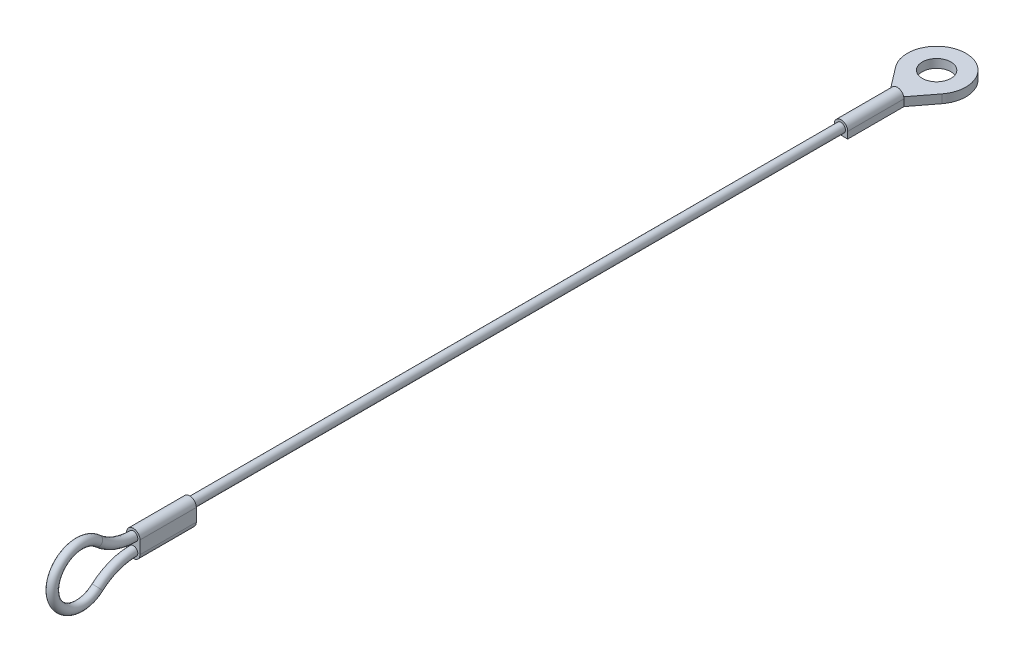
ISO-10303-21;
HEADER;
FILE_DESCRIPTION(('STEP AP214'),'2;1');
FILE_NAME('part.step','',(''),(''),'','','');
FILE_SCHEMA(('AUTOMOTIVE_DESIGN { 1 0 10303 214 1 1 1 1 }'));
ENDSEC;
DATA;
#1=APPLICATION_CONTEXT('core data for automotive mechanical design processes');
#2=APPLICATION_PROTOCOL_DEFINITION('international standard','automotive_design',2000,#1);
#3=PRODUCT_CONTEXT('',#1,'mechanical');
#4=PRODUCT('Part','Part','',(#3));
#5=PRODUCT_RELATED_PRODUCT_CATEGORY('part','',(#4));
#6=PRODUCT_DEFINITION_FORMATION('','',#4);
#7=PRODUCT_DEFINITION_CONTEXT('part definition',#1,'design');
#8=PRODUCT_DEFINITION('design','',#6,#7);
#9=PRODUCT_DEFINITION_SHAPE('','',#8);
#10=(LENGTH_UNIT() NAMED_UNIT(*) SI_UNIT(.MILLI.,.METRE.));
#11=(NAMED_UNIT(*) PLANE_ANGLE_UNIT() SI_UNIT($,.RADIAN.));
#12=(NAMED_UNIT(*) SI_UNIT($,.STERADIAN.) SOLID_ANGLE_UNIT());
#13=UNCERTAINTY_MEASURE_WITH_UNIT(LENGTH_MEASURE(1.E-05),#10,'distance_accuracy_value','');
#14=(GEOMETRIC_REPRESENTATION_CONTEXT(3) GLOBAL_UNCERTAINTY_ASSIGNED_CONTEXT((#13)) GLOBAL_UNIT_ASSIGNED_CONTEXT((#10,
#11,#12)) REPRESENTATION_CONTEXT('',''));
#15=CARTESIAN_POINT('',(0.,0.,0.));
#16=DIRECTION('',(0.,0.,1.));
#17=DIRECTION('',(1.,0.,0.));
#18=AXIS2_PLACEMENT_3D('',#15,#16,#17);
#19=CARTESIAN_POINT('',(0.,0.,-10.));
#20=DIRECTION('',(0.,0.,-1.));
#21=DIRECTION('',(-1.,0.,0.));
#22=AXIS2_PLACEMENT_3D('',#19,#20,#21);
#23=PLANE('',#22);
#24=CARTESIAN_POINT('',(0.,0.,-10.));
#25=DIRECTION('',(0.,0.,-1.));
#26=DIRECTION('',(-1.,0.,0.));
#27=AXIS2_PLACEMENT_3D('',#24,#25,#26);
#28=CIRCLE('',#27,1.195);
#29=CARTESIAN_POINT('',(-1.1499565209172,0.325,-10.));
#30=VERTEX_POINT('',#29);
#31=CARTESIAN_POINT('',(1.1499565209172,0.325,-10.));
#32=VERTEX_POINT('',#31);
#33=EDGE_CURVE('E200',#30,#32,#28,.T.);
#34=ORIENTED_EDGE('',*,*,#33,.T.);
#35=DIRECTION('',(-1.,0.,0.));
#36=VECTOR('',#35,1.);
#37=CARTESIAN_POINT('',(-1.195,0.325,-10.));
#38=LINE('',#37,#36);
#39=EDGE_CURVE('E11',#32,#30,#38,.T.);
#40=ORIENTED_EDGE('',*,*,#39,.T.);
#41=EDGE_LOOP('',(#34,#40));
#42=FACE_BOUND('',#41,.T.);
#43=ADVANCED_FACE('F39',(#42),#23,.T.);
#44=CARTESIAN_POINT('',(0.,0.,125.8));
#45=DIRECTION('',(0.,0.,-1.));
#46=DIRECTION('',(-1.,0.,0.));
#47=AXIS2_PLACEMENT_3D('',#44,#45,#46);
#48=CYLINDRICAL_SURFACE('',#47,0.795);
#49=CARTESIAN_POINT('',(0.,0.,115.8));
#50=DIRECTION('',(0.,0.,-1.));
#51=DIRECTION('',(0.,1.,0.));
#52=AXIS2_PLACEMENT_3D('',#49,#50,#51);
#53=CIRCLE('',#52,0.795);
#54=CARTESIAN_POINT('',(0.,0.795,115.8));
#55=VERTEX_POINT('',#54);
#56=EDGE_CURVE('E43',#55,#55,#53,.T.);
#57=ORIENTED_EDGE('',*,*,#56,.T.);
#58=EDGE_LOOP('',(#57));
#59=FACE_BOUND('',#58,.T.);
#60=CARTESIAN_POINT('',(0.,0.,0.));
#61=DIRECTION('',(0.,0.,1.));
#62=DIRECTION('',(1.,0.,0.));
#63=AXIS2_PLACEMENT_3D('',#60,#61,#62);
#64=CIRCLE('',#63,0.795);
#65=CARTESIAN_POINT('',(0.795,0.,0.));
#66=VERTEX_POINT('',#65);
#67=EDGE_CURVE('E236',#66,#66,#64,.T.);
#68=ORIENTED_EDGE('',*,*,#67,.T.);
#69=EDGE_LOOP('',(#68));
#70=FACE_BOUND('',#69,.T.);
#71=ADVANCED_FACE('F41',(#59,#70),#48,.T.);
#72=CARTESIAN_POINT('',(0.,1.99637760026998E-12,115.8));
#73=DIRECTION('',(0.,0.,1.));
#74=DIRECTION('',(0.,-1.,0.));
#75=AXIS2_PLACEMENT_3D('',#72,#73,#74);
#76=CYLINDRICAL_SURFACE('',#75,1.195);
#77=CARTESIAN_POINT('',(0.,2.01083362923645E-12,125.8));
#78=DIRECTION('',(0.,0.,-1.));
#79=DIRECTION('',(0.,1.,0.));
#80=AXIS2_PLACEMENT_3D('',#77,#78,#79);
#81=CIRCLE('',#80,1.195);
#82=CARTESIAN_POINT('',(-1.195,2.01097997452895E-12,125.8));
#83=VERTEX_POINT('',#82);
#84=CARTESIAN_POINT('',(1.195,2.01068728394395E-12,125.8));
#85=VERTEX_POINT('',#84);
#86=EDGE_CURVE('E248',#83,#85,#81,.T.);
#87=ORIENTED_EDGE('',*,*,#86,.T.);
#88=DIRECTION('',(0.,0.,1.));
#89=VECTOR('',#88,1.);
#90=CARTESIAN_POINT('',(1.195,1.99623125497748E-12,115.8));
#91=LINE('',#90,#89);
#92=CARTESIAN_POINT('',(1.195,1.99623125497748E-12,115.8));
#93=VERTEX_POINT('',#92);
#94=EDGE_CURVE('E269',#93,#85,#91,.T.);
#95=ORIENTED_EDGE('',*,*,#94,.F.);
#96=CARTESIAN_POINT('',(0.,1.99637760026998E-12,115.8));
#97=DIRECTION('',(0.,0.,-1.));
#98=DIRECTION('',(0.,1.,0.));
#99=AXIS2_PLACEMENT_3D('',#96,#97,#98);
#100=CIRCLE('',#99,1.195);
#101=CARTESIAN_POINT('',(-1.195,1.99652394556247E-12,115.8));
#102=VERTEX_POINT('',#101);
#103=EDGE_CURVE('E237',#102,#93,#100,.T.);
#104=ORIENTED_EDGE('',*,*,#103,.F.);
#105=DIRECTION('',(0.,0.,1.));
#106=VECTOR('',#105,1.);
#107=CARTESIAN_POINT('',(-1.195,1.99652394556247E-12,115.8));
#108=LINE('',#107,#106);
#109=EDGE_CURVE('E247',#102,#83,#108,.T.);
#110=ORIENTED_EDGE('',*,*,#109,.T.);
#111=EDGE_LOOP('',(#87,#95,#104,#110));
#112=FACE_BOUND('',#111,.T.);
#113=ADVANCED_FACE('F329',(#112),#76,.T.);
#114=CARTESIAN_POINT('',(1.195,1.99623125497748E-12,115.8));
#115=DIRECTION('',(-1.,0.,0.));
#116=DIRECTION('',(0.,-1.,0.));
#117=AXIS2_PLACEMENT_3D('',#114,#115,#116);
#118=PLANE('',#117);
#119=DIRECTION('',(0.,-1.,0.));
#120=VECTOR('',#119,1.);
#121=CARTESIAN_POINT('',(1.195,2.01068728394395E-12,125.8));
#122=LINE('',#121,#120);
#123=CARTESIAN_POINT('',(1.195,-2.26625258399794,125.8));
#124=VERTEX_POINT('',#123);
#125=EDGE_CURVE('E252',#85,#124,#122,.T.);
#126=ORIENTED_EDGE('',*,*,#125,.T.);
#127=DIRECTION('',(0.,0.,1.));
#128=VECTOR('',#127,1.);
#129=CARTESIAN_POINT('',(1.195,-2.26625258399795,115.8));
#130=LINE('',#129,#128);
#131=CARTESIAN_POINT('',(1.195,-2.26625258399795,115.8));
#132=VERTEX_POINT('',#131);
#133=EDGE_CURVE('E265',#132,#124,#130,.T.);
#134=ORIENTED_EDGE('',*,*,#133,.F.);
#135=DIRECTION('',(0.,-1.,0.));
#136=VECTOR('',#135,1.);
#137=CARTESIAN_POINT('',(1.195,1.99623125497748E-12,115.8));
#138=LINE('',#137,#136);
#139=EDGE_CURVE('E96',#93,#132,#138,.T.);
#140=ORIENTED_EDGE('',*,*,#139,.F.);
#141=ORIENTED_EDGE('',*,*,#94,.T.);
#142=EDGE_LOOP('',(#126,#134,#140,#141));
#143=FACE_BOUND('',#142,.T.);
#144=ADVANCED_FACE('F358',(#143),#118,.F.);
#145=CARTESIAN_POINT('',(0.,-2.26625258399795,115.8));
#146=DIRECTION('',(0.,0.,1.));
#147=DIRECTION('',(0.,-1.,0.));
#148=AXIS2_PLACEMENT_3D('',#145,#146,#147);
#149=CYLINDRICAL_SURFACE('',#148,1.195);
#150=CARTESIAN_POINT('',(0.,-2.26625258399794,125.8));
#151=DIRECTION('',(0.,0.,-1.));
#152=DIRECTION('',(0.,1.,0.));
#153=AXIS2_PLACEMENT_3D('',#150,#151,#152);
#154=CIRCLE('',#153,1.195);
#155=CARTESIAN_POINT('',(-1.195,-2.26625258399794,125.8));
#156=VERTEX_POINT('',#155);
#157=EDGE_CURVE('E255',#124,#156,#154,.T.);
#158=ORIENTED_EDGE('',*,*,#157,.T.);
#159=DIRECTION('',(0.,0.,1.));
#160=VECTOR('',#159,1.);
#161=CARTESIAN_POINT('',(-1.195,-2.26625258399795,115.8));
#162=LINE('',#161,#160);
#163=CARTESIAN_POINT('',(-1.195,-2.26625258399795,115.8));
#164=VERTEX_POINT('',#163);
#165=EDGE_CURVE('E262',#164,#156,#162,.T.);
#166=ORIENTED_EDGE('',*,*,#165,.F.);
#167=CARTESIAN_POINT('',(0.,-2.26625258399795,115.8));
#168=DIRECTION('',(0.,0.,-1.));
#169=DIRECTION('',(0.,1.,0.));
#170=AXIS2_PLACEMENT_3D('',#167,#168,#169);
#171=CIRCLE('',#170,1.195);
#172=EDGE_CURVE('E242',#132,#164,#171,.T.);
#173=ORIENTED_EDGE('',*,*,#172,.F.);
#174=ORIENTED_EDGE('',*,*,#133,.T.);
#175=EDGE_LOOP('',(#158,#166,#173,#174));
#176=FACE_BOUND('',#175,.T.);
#177=ADVANCED_FACE('F355',(#176),#149,.T.);
#178=CARTESIAN_POINT('',(-1.195,1.99652394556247E-12,115.8));
#179=DIRECTION('',(1.,0.,0.));
#180=DIRECTION('',(0.,0.,-1.));
#181=AXIS2_PLACEMENT_3D('',#178,#179,#180);
#182=PLANE('',#181);
#183=DIRECTION('',(0.,1.,0.));
#184=VECTOR('',#183,1.);
#185=CARTESIAN_POINT('',(-1.195,2.01097997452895E-12,125.8));
#186=LINE('',#185,#184);
#187=EDGE_CURVE('E88',#156,#83,#186,.T.);
#188=ORIENTED_EDGE('',*,*,#187,.T.);
#189=ORIENTED_EDGE('',*,*,#109,.F.);
#190=DIRECTION('',(0.,1.,0.));
#191=VECTOR('',#190,1.);
#192=CARTESIAN_POINT('',(-1.195,1.99652394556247E-12,115.8));
#193=LINE('',#192,#191);
#194=EDGE_CURVE('E67',#164,#102,#193,.T.);
#195=ORIENTED_EDGE('',*,*,#194,.F.);
#196=ORIENTED_EDGE('',*,*,#165,.T.);
#197=EDGE_LOOP('',(#188,#189,#195,#196));
#198=FACE_BOUND('',#197,.T.);
#199=ADVANCED_FACE('F347',(#198),#182,.F.);
#200=CARTESIAN_POINT('',(0.,1.99637760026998E-12,115.8));
#201=DIRECTION('',(0.,0.,-1.));
#202=DIRECTION('',(0.,1.,0.));
#203=AXIS2_PLACEMENT_3D('',#200,#201,#202);
#204=PLANE('',#203);
#205=ORIENTED_EDGE('',*,*,#56,.F.);
#206=EDGE_LOOP('',(#205));
#207=FACE_BOUND('',#206,.T.);
#208=ORIENTED_EDGE('',*,*,#103,.T.);
#209=ORIENTED_EDGE('',*,*,#139,.T.);
#210=ORIENTED_EDGE('',*,*,#172,.T.);
#211=ORIENTED_EDGE('',*,*,#194,.T.);
#212=EDGE_LOOP('',(#208,#209,#210,#211));
#213=FACE_BOUND('',#212,.T.);
#214=ADVANCED_FACE('F343',(#207,#213),#204,.T.);
#215=CARTESIAN_POINT('',(0.,2.01083362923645E-12,125.8));
#216=DIRECTION('',(0.,0.,-1.));
#217=DIRECTION('',(0.,1.,0.));
#218=AXIS2_PLACEMENT_3D('',#215,#216,#217);
#219=PLANE('',#218);
#220=CARTESIAN_POINT('',(0.,-2.26625258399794,125.8));
#221=DIRECTION('',(0.,0.,-1.));
#222=DIRECTION('',(1.,0.,0.));
#223=AXIS2_PLACEMENT_3D('',#220,#221,#222);
#224=CIRCLE('',#223,0.795);
#225=CARTESIAN_POINT('',(0.,-1.47125258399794,125.8));
#226=VERTEX_POINT('',#225);
#227=EDGE_CURVE('E276',#226,#226,#224,.T.);
#228=ORIENTED_EDGE('',*,*,#227,.T.);
#229=EDGE_LOOP('',(#228));
#230=FACE_BOUND('',#229,.T.);
#231=CARTESIAN_POINT('',(0.,0.,125.8));
#232=DIRECTION('',(0.,0.,-1.));
#233=DIRECTION('',(0.,1.,0.));
#234=AXIS2_PLACEMENT_3D('',#231,#232,#233);
#235=CIRCLE('',#234,0.795);
#236=CARTESIAN_POINT('',(0.,-0.794999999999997,125.8));
#237=VERTEX_POINT('',#236);
#238=EDGE_CURVE('E272',#237,#237,#235,.T.);
#239=ORIENTED_EDGE('',*,*,#238,.T.);
#240=EDGE_LOOP('',(#239));
#241=FACE_BOUND('',#240,.T.);
#242=ORIENTED_EDGE('',*,*,#86,.F.);
#243=ORIENTED_EDGE('',*,*,#187,.F.);
#244=ORIENTED_EDGE('',*,*,#157,.F.);
#245=ORIENTED_EDGE('',*,*,#125,.F.);
#246=EDGE_LOOP('',(#242,#243,#244,#245));
#247=FACE_BOUND('',#246,.T.);
#248=ADVANCED_FACE('F346',(#230,#241,#247),#219,.F.);
#249=CARTESIAN_POINT('',(0.,-11.8662525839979,125.8));
#250=DIRECTION('',(1.,0.,0.));
#251=DIRECTION('',(0.,0.,-1.));
#252=AXIS2_PLACEMENT_3D('',#249,#250,#251);
#253=TOROIDAL_SURFACE('',#252,9.6,0.795);
#254=CARTESIAN_POINT('',(0.,-4.71083505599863,132.2));
#255=DIRECTION('',(0.,0.666666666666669,-0.745355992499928));
#256=DIRECTION('',(1.,0.,0.));
#257=AXIS2_PLACEMENT_3D('',#254,#255,#256);
#258=CIRCLE('',#257,0.795);
#259=CARTESIAN_POINT('',(0.,-4.11827704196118,132.73));
#260=VERTEX_POINT('',#259);
#261=EDGE_CURVE('E279',#260,#260,#258,.T.);
#262=CARTESIAN_POINT('',(0.,-11.8662525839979,125.8));
#263=DIRECTION('',(1.,0.,0.));
#264=DIRECTION('',(0.,0.,-1.));
#265=AXIS2_PLACEMENT_3D('',#262,#263,#264);
#266=CIRCLE('',#265,10.395);
#267=EDGE_CURVE('',#226,#260,#266,.T.);
#268=ORIENTED_EDGE('',*,*,#227,.F.);
#269=ORIENTED_EDGE('',*,*,#261,.T.);
#270=ORIENTED_EDGE('',*,*,#267,.T.);
#271=ORIENTED_EDGE('',*,*,#267,.F.);
#272=EDGE_LOOP('',(#268,#270,#269,#271));
#273=FACE_BOUND('',#272,.T.);
#274=ADVANCED_FACE('F351',(#273),#253,.T.);
#275=CARTESIAN_POINT('',(0.,-1.13312629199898,135.4));
#276=DIRECTION('',(-1.,0.,0.));
#277=DIRECTION('',(0.,0.,1.));
#278=AXIS2_PLACEMENT_3D('',#275,#276,#277);
#279=TOROIDAL_SURFACE('',#278,4.8,0.795);
#280=CARTESIAN_POINT('',(0.,2.44458247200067,132.2));
#281=DIRECTION('',(0.,0.666666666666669,0.745355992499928));
#282=DIRECTION('',(1.,0.,0.));
#283=AXIS2_PLACEMENT_3D('',#280,#281,#282);
#284=CIRCLE('',#283,0.795);
#285=CARTESIAN_POINT('',(0.,1.85202445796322,132.73));
#286=VERTEX_POINT('',#285);
#287=EDGE_CURVE('E49',#286,#286,#284,.T.);
#288=ORIENTED_EDGE('',*,*,#287,.T.);
#289=EDGE_LOOP('',(#288));
#290=FACE_BOUND('',#289,.T.);
#291=ORIENTED_EDGE('',*,*,#261,.F.);
#292=EDGE_LOOP('',(#291));
#293=FACE_BOUND('',#292,.T.);
#294=ADVANCED_FACE('F367',(#290,#293),#279,.T.);
#295=CARTESIAN_POINT('',(0.,9.6,125.8));
#296=DIRECTION('',(1.,0.,0.));
#297=DIRECTION('',(0.,0.,-1.));
#298=AXIS2_PLACEMENT_3D('',#295,#296,#297);
#299=TOROIDAL_SURFACE('',#298,9.6,0.795);
#300=CARTESIAN_POINT('',(0.,9.6,125.8));
#301=DIRECTION('',(1.,0.,0.));
#302=DIRECTION('',(0.,0.,-1.));
#303=AXIS2_PLACEMENT_3D('',#300,#301,#302);
#304=CIRCLE('',#303,10.395);
#305=EDGE_CURVE('',#286,#237,#304,.T.);
#306=ORIENTED_EDGE('',*,*,#287,.F.);
#307=ORIENTED_EDGE('',*,*,#238,.F.);
#308=ORIENTED_EDGE('',*,*,#305,.T.);
#309=ORIENTED_EDGE('',*,*,#305,.F.);
#310=EDGE_LOOP('',(#306,#308,#307,#309));
#311=FACE_BOUND('',#310,.T.);
#312=ADVANCED_FACE('F342',(#311),#299,.T.);
#313=CARTESIAN_POINT('',(0.,0.,-10.));
#314=DIRECTION('',(0.,0.,1.));
#315=DIRECTION('',(1.,0.,0.));
#316=AXIS2_PLACEMENT_3D('',#313,#314,#315);
#317=CYLINDRICAL_SURFACE('',#316,1.195);
#318=CARTESIAN_POINT('',(0.,0.,0.));
#319=DIRECTION('',(0.,0.,-1.));
#320=DIRECTION('',(-1.,0.,0.));
#321=AXIS2_PLACEMENT_3D('',#318,#319,#320);
#322=CIRCLE('',#321,1.195);
#323=CARTESIAN_POINT('',(-1.195,0.,0.));
#324=VERTEX_POINT('',#323);
#325=CARTESIAN_POINT('',(1.195,0.,0.));
#326=VERTEX_POINT('',#325);
#327=EDGE_CURVE('E189',#324,#326,#322,.T.);
#328=ORIENTED_EDGE('',*,*,#327,.T.);
#329=DIRECTION('',(0.,0.,1.));
#330=VECTOR('',#329,1.);
#331=CARTESIAN_POINT('',(1.195,0.,-10.));
#332=LINE('',#331,#330);
#333=CARTESIAN_POINT('',(1.195,0.,-10.));
#334=VERTEX_POINT('',#333);
#335=EDGE_CURVE('E232',#334,#326,#332,.T.);
#336=ORIENTED_EDGE('',*,*,#335,.F.);
#337=EDGE_CURVE('E201',#32,#334,#28,.T.);
#338=ORIENTED_EDGE('',*,*,#337,.F.);
#339=ORIENTED_EDGE('',*,*,#33,.F.);
#340=CARTESIAN_POINT('',(-1.195,0.,-10.));
#341=VERTEX_POINT('',#340);
#342=EDGE_CURVE('E196',#341,#30,#28,.T.);
#343=ORIENTED_EDGE('',*,*,#342,.F.);
#344=DIRECTION('',(0.,0.,1.));
#345=VECTOR('',#344,1.);
#346=CARTESIAN_POINT('',(-1.195,0.,-10.));
#347=LINE('',#346,#345);
#348=EDGE_CURVE('E207',#341,#324,#347,.T.);
#349=ORIENTED_EDGE('',*,*,#348,.T.);
#350=EDGE_LOOP('',(#328,#336,#338,#339,#343,#349));
#351=FACE_BOUND('',#350,.T.);
#352=ADVANCED_FACE('F300',(#351),#317,.T.);
#353=CARTESIAN_POINT('',(1.195,0.,-10.));
#354=DIRECTION('',(-1.,0.,0.));
#355=DIRECTION('',(0.,-1.,0.));
#356=AXIS2_PLACEMENT_3D('',#353,#354,#355);
#357=PLANE('',#356);
#358=DIRECTION('',(0.,-1.,0.));
#359=VECTOR('',#358,1.);
#360=CARTESIAN_POINT('',(1.195,0.,0.));
#361=LINE('',#360,#359);
#362=CARTESIAN_POINT('',(1.195,-1.195,0.));
#363=VERTEX_POINT('',#362);
#364=EDGE_CURVE('E211',#326,#363,#361,.T.);
#365=ORIENTED_EDGE('',*,*,#364,.T.);
#366=DIRECTION('',(0.,0.,1.));
#367=VECTOR('',#366,1.);
#368=CARTESIAN_POINT('',(1.195,-1.195,-10.));
#369=LINE('',#368,#367);
#370=CARTESIAN_POINT('',(1.195,-1.195,-10.));
#371=VERTEX_POINT('',#370);
#372=EDGE_CURVE('E228',#371,#363,#369,.T.);
#373=ORIENTED_EDGE('',*,*,#372,.F.);
#374=DIRECTION('',(0.,-1.,0.));
#375=VECTOR('',#374,1.);
#376=CARTESIAN_POINT('',(1.195,0.,-10.));
#377=LINE('',#376,#375);
#378=EDGE_CURVE('E199',#334,#371,#377,.T.);
#379=ORIENTED_EDGE('',*,*,#378,.F.);
#380=ORIENTED_EDGE('',*,*,#335,.T.);
#381=EDGE_LOOP('',(#365,#373,#379,#380));
#382=FACE_BOUND('',#381,.T.);
#383=ADVANCED_FACE('F313',(#382),#357,.F.);
#384=CARTESIAN_POINT('',(0.,-1.195,-10.));
#385=DIRECTION('',(0.,1.,0.));
#386=DIRECTION('',(0.,0.,1.));
#387=AXIS2_PLACEMENT_3D('',#384,#385,#386);
#388=PLANE('',#387);
#389=DIRECTION('',(-1.,0.,0.));
#390=VECTOR('',#389,1.);
#391=CARTESIAN_POINT('',(0.,-1.195,0.));
#392=LINE('',#391,#390);
#393=CARTESIAN_POINT('',(-1.195,-1.195,0.));
#394=VERTEX_POINT('',#393);
#395=EDGE_CURVE('E215',#363,#394,#392,.T.);
#396=ORIENTED_EDGE('',*,*,#395,.T.);
#397=DIRECTION('',(0.,0.,1.));
#398=VECTOR('',#397,1.);
#399=CARTESIAN_POINT('',(-1.195,-1.195,-10.));
#400=LINE('',#399,#398);
#401=CARTESIAN_POINT('',(-1.195,-1.195,-10.));
#402=VERTEX_POINT('',#401);
#403=EDGE_CURVE('E224',#402,#394,#400,.T.);
#404=ORIENTED_EDGE('',*,*,#403,.F.);
#405=DIRECTION('',(-0.608040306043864,0.,-0.793906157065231));
#406=VECTOR('',#405,1.);
#407=CARTESIAN_POINT('',(-4.13228154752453,-1.195,-13.8351502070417));
#408=LINE('',#407,#406);
#409=CARTESIAN_POINT('',(-4.13228154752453,-1.195,-13.8351502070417));
#410=VERTEX_POINT('',#409);
#411=EDGE_CURVE('E181',#402,#410,#408,.T.);
#412=ORIENTED_EDGE('',*,*,#411,.T.);
#413=CARTESIAN_POINT('',(0.,-1.195,-17.));
#414=DIRECTION('',(0.,-1.,0.));
#415=DIRECTION('',(0.,0.,1.));
#416=AXIS2_PLACEMENT_3D('',#413,#414,#415);
#417=CIRCLE('',#416,5.205);
#418=CARTESIAN_POINT('',(4.13228154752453,-1.195,-13.8351502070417));
#419=VERTEX_POINT('',#418);
#420=EDGE_CURVE('E147',#410,#419,#417,.T.);
#421=ORIENTED_EDGE('',*,*,#420,.T.);
#422=DIRECTION('',(-0.608040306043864,0.,0.793906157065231));
#423=VECTOR('',#422,1.);
#424=CARTESIAN_POINT('',(1.195,-1.195,-10.));
#425=LINE('',#424,#423);
#426=EDGE_CURVE('E167',#419,#371,#425,.T.);
#427=ORIENTED_EDGE('',*,*,#426,.T.);
#428=ORIENTED_EDGE('',*,*,#372,.T.);
#429=EDGE_LOOP('',(#396,#404,#412,#421,#427,#428));
#430=FACE_BOUND('',#429,.T.);
#431=CARTESIAN_POINT('',(0.,-1.195,-17.));
#432=DIRECTION('',(0.,-1.,0.));
#433=DIRECTION('',(0.,0.,-1.));
#434=AXIS2_PLACEMENT_3D('',#431,#432,#433);
#435=CIRCLE('',#434,2.54);
#436=CARTESIAN_POINT('',(0.,-1.195,-19.54));
#437=VERTEX_POINT('',#436);
#438=EDGE_CURVE('E174',#437,#437,#435,.T.);
#439=ORIENTED_EDGE('',*,*,#438,.F.);
#440=EDGE_LOOP('',(#439));
#441=FACE_BOUND('',#440,.T.);
#442=ADVANCED_FACE('F309',(#430,#441),#388,.F.);
#443=CARTESIAN_POINT('',(-1.195,-1.195,-10.));
#444=DIRECTION('',(1.,0.,0.));
#445=DIRECTION('',(0.,1.,0.));
#446=AXIS2_PLACEMENT_3D('',#443,#444,#445);
#447=PLANE('',#446);
#448=DIRECTION('',(0.,1.,0.));
#449=VECTOR('',#448,1.);
#450=CARTESIAN_POINT('',(-1.195,-1.195,0.));
#451=LINE('',#450,#449);
#452=EDGE_CURVE('E218',#394,#324,#451,.T.);
#453=ORIENTED_EDGE('',*,*,#452,.T.);
#454=ORIENTED_EDGE('',*,*,#348,.F.);
#455=DIRECTION('',(0.,1.,0.));
#456=VECTOR('',#455,1.);
#457=CARTESIAN_POINT('',(-1.195,-1.195,-10.));
#458=LINE('',#457,#456);
#459=EDGE_CURVE('E204',#402,#341,#458,.T.);
#460=ORIENTED_EDGE('',*,*,#459,.F.);
#461=ORIENTED_EDGE('',*,*,#403,.T.);
#462=EDGE_LOOP('',(#453,#454,#460,#461));
#463=FACE_BOUND('',#462,.T.);
#464=ADVANCED_FACE('F294',(#463),#447,.F.);
#465=CARTESIAN_POINT('',(0.,0.,0.));
#466=DIRECTION('',(0.,0.,-1.));
#467=DIRECTION('',(-1.,0.,0.));
#468=AXIS2_PLACEMENT_3D('',#465,#466,#467);
#469=PLANE('',#468);
#470=ORIENTED_EDGE('',*,*,#67,.F.);
#471=EDGE_LOOP('',(#470));
#472=FACE_BOUND('',#471,.T.);
#473=ORIENTED_EDGE('',*,*,#327,.F.);
#474=ORIENTED_EDGE('',*,*,#452,.F.);
#475=ORIENTED_EDGE('',*,*,#395,.F.);
#476=ORIENTED_EDGE('',*,*,#364,.F.);
#477=EDGE_LOOP('',(#473,#474,#475,#476));
#478=FACE_BOUND('',#477,.T.);
#479=ADVANCED_FACE('F290',(#472,#478),#469,.F.);
#480=CARTESIAN_POINT('',(-1.195,0.325,-10.));
#481=DIRECTION('',(0.,0.,1.));
#482=DIRECTION('',(1.,0.,0.));
#483=AXIS2_PLACEMENT_3D('',#480,#481,#482);
#484=PLANE('',#483);
#485=DIRECTION('',(0.,-1.,0.));
#486=VECTOR('',#485,1.);
#487=CARTESIAN_POINT('',(-1.195,0.325,-10.));
#488=LINE('',#487,#486);
#489=CARTESIAN_POINT('',(-1.195,0.325,-10.));
#490=VERTEX_POINT('',#489);
#491=EDGE_CURVE('E165',#490,#341,#488,.T.);
#492=ORIENTED_EDGE('',*,*,#491,.T.);
#493=ORIENTED_EDGE('',*,*,#342,.T.);
#494=EDGE_CURVE('E52',#30,#490,#38,.T.);
#495=ORIENTED_EDGE('',*,*,#494,.T.);
#496=EDGE_LOOP('',(#492,#493,#495));
#497=FACE_BOUND('',#496,.T.);
#498=ADVANCED_FACE('F293',(#497),#484,.T.);
#499=CARTESIAN_POINT('',(-4.13228154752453,0.325,-13.8351502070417));
#500=DIRECTION('',(-0.793906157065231,0.,0.608040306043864));
#501=DIRECTION('',(0.608040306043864,0.,0.793906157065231));
#502=AXIS2_PLACEMENT_3D('',#499,#500,#501);
#503=PLANE('',#502);
#504=ORIENTED_EDGE('',*,*,#411,.F.);
#505=ORIENTED_EDGE('',*,*,#459,.T.);
#506=ORIENTED_EDGE('',*,*,#491,.F.);
#507=DIRECTION('',(-0.608040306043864,0.,-0.793906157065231));
#508=VECTOR('',#507,1.);
#509=CARTESIAN_POINT('',(-4.13228154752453,0.325,-13.8351502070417));
#510=LINE('',#509,#508);
#511=CARTESIAN_POINT('',(-4.13228154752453,0.325,-13.8351502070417));
#512=VERTEX_POINT('',#511);
#513=EDGE_CURVE('E156',#490,#512,#510,.T.);
#514=ORIENTED_EDGE('',*,*,#513,.T.);
#515=DIRECTION('',(0.,-1.,0.));
#516=VECTOR('',#515,1.);
#517=CARTESIAN_POINT('',(-4.13228154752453,0.325,-13.8351502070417));
#518=LINE('',#517,#516);
#519=EDGE_CURVE('E142',#512,#410,#518,.T.);
#520=ORIENTED_EDGE('',*,*,#519,.T.);
#521=EDGE_LOOP('',(#504,#505,#506,#514,#520));
#522=FACE_BOUND('',#521,.T.);
#523=ADVANCED_FACE('F163',(#522),#503,.T.);
#524=CARTESIAN_POINT('',(1.195,0.325,-10.));
#525=VERTEX_POINT('',#524);
#526=EDGE_CURVE('E51',#525,#32,#38,.T.);
#527=ORIENTED_EDGE('',*,*,#526,.T.);
#528=ORIENTED_EDGE('',*,*,#337,.T.);
#529=DIRECTION('',(0.,-1.,0.));
#530=VECTOR('',#529,1.);
#531=CARTESIAN_POINT('',(1.195,0.325,-10.));
#532=LINE('',#531,#530);
#533=EDGE_CURVE('E190',#525,#334,#532,.T.);
#534=ORIENTED_EDGE('',*,*,#533,.F.);
#535=EDGE_LOOP('',(#527,#528,#534));
#536=FACE_BOUND('',#535,.T.);
#537=ADVANCED_FACE('F319',(#536),#484,.T.);
#538=CARTESIAN_POINT('',(1.195,0.325,-10.));
#539=DIRECTION('',(0.793906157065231,0.,0.608040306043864));
#540=DIRECTION('',(0.608040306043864,0.,-0.793906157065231));
#541=AXIS2_PLACEMENT_3D('',#538,#539,#540);
#542=PLANE('',#541);
#543=ORIENTED_EDGE('',*,*,#426,.F.);
#544=DIRECTION('',(0.,-1.,0.));
#545=VECTOR('',#544,1.);
#546=CARTESIAN_POINT('',(4.13228154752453,0.325,-13.8351502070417));
#547=LINE('',#546,#545);
#548=CARTESIAN_POINT('',(4.13228154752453,0.325,-13.8351502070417));
#549=VERTEX_POINT('',#548);
#550=EDGE_CURVE('E152',#549,#419,#547,.T.);
#551=ORIENTED_EDGE('',*,*,#550,.F.);
#552=DIRECTION('',(-0.608040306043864,0.,0.793906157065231));
#553=VECTOR('',#552,1.);
#554=CARTESIAN_POINT('',(1.195,0.325,-10.));
#555=LINE('',#554,#553);
#556=EDGE_CURVE('E159',#549,#525,#555,.T.);
#557=ORIENTED_EDGE('',*,*,#556,.T.);
#558=ORIENTED_EDGE('',*,*,#533,.T.);
#559=ORIENTED_EDGE('',*,*,#378,.T.);
#560=EDGE_LOOP('',(#543,#551,#557,#558,#559));
#561=FACE_BOUND('',#560,.T.);
#562=ADVANCED_FACE('F317',(#561),#542,.T.);
#563=CARTESIAN_POINT('',(0.,0.325,-17.));
#564=DIRECTION('',(0.,-1.,0.));
#565=DIRECTION('',(0.,0.,-1.));
#566=AXIS2_PLACEMENT_3D('',#563,#564,#565);
#567=CYLINDRICAL_SURFACE('',#566,5.205);
#568=ORIENTED_EDGE('',*,*,#420,.F.);
#569=ORIENTED_EDGE('',*,*,#519,.F.);
#570=CARTESIAN_POINT('',(0.,0.325,-17.));
#571=DIRECTION('',(0.,-1.,0.));
#572=DIRECTION('',(0.,0.,1.));
#573=AXIS2_PLACEMENT_3D('',#570,#571,#572);
#574=CIRCLE('',#573,5.205);
#575=EDGE_CURVE('E145',#512,#549,#574,.T.);
#576=ORIENTED_EDGE('',*,*,#575,.T.);
#577=ORIENTED_EDGE('',*,*,#550,.T.);
#578=EDGE_LOOP('',(#568,#569,#576,#577));
#579=FACE_BOUND('',#578,.T.);
#580=ADVANCED_FACE('F144',(#579),#567,.T.);
#581=CARTESIAN_POINT('',(0.,0.325,-17.));
#582=DIRECTION('',(0.,1.,0.));
#583=DIRECTION('',(0.,0.,1.));
#584=AXIS2_PLACEMENT_3D('',#581,#582,#583);
#585=PLANE('',#584);
#586=CARTESIAN_POINT('',(0.,0.325,-17.));
#587=DIRECTION('',(0.,-1.,0.));
#588=DIRECTION('',(0.,0.,-1.));
#589=AXIS2_PLACEMENT_3D('',#586,#587,#588);
#590=CIRCLE('',#589,2.54);
#591=CARTESIAN_POINT('',(0.,0.325,-19.54));
#592=VERTEX_POINT('',#591);
#593=EDGE_CURVE('E184',#592,#592,#590,.T.);
#594=ORIENTED_EDGE('',*,*,#593,.T.);
#595=EDGE_LOOP('',(#594));
#596=FACE_BOUND('',#595,.T.);
#597=ORIENTED_EDGE('',*,*,#513,.F.);
#598=ORIENTED_EDGE('',*,*,#494,.F.);
#599=ORIENTED_EDGE('',*,*,#39,.F.);
#600=ORIENTED_EDGE('',*,*,#526,.F.);
#601=ORIENTED_EDGE('',*,*,#556,.F.);
#602=ORIENTED_EDGE('',*,*,#575,.F.);
#603=EDGE_LOOP('',(#597,#598,#599,#600,#601,#602));
#604=FACE_BOUND('',#603,.T.);
#605=ADVANCED_FACE('F155',(#596,#604),#585,.T.);
#606=CARTESIAN_POINT('',(0.,0.325,-17.));
#607=DIRECTION('',(0.,-1.,0.));
#608=DIRECTION('',(0.,0.,-1.));
#609=AXIS2_PLACEMENT_3D('',#606,#607,#608);
#610=CYLINDRICAL_SURFACE('',#609,2.54);
#611=ORIENTED_EDGE('',*,*,#593,.F.);
#612=EDGE_LOOP('',(#611));
#613=FACE_BOUND('',#612,.T.);
#614=ORIENTED_EDGE('',*,*,#438,.T.);
#615=EDGE_LOOP('',(#614));
#616=FACE_BOUND('',#615,.T.);
#617=ADVANCED_FACE('F435',(#613,#616),#610,.F.);
#618=CLOSED_SHELL('',(#43,#71,#113,#144,#177,#199,#214,#248,#274,#294,#312,#352,#383,#442,#464,
#479,#498,#523,#537,#562,#580,#605,#617));
#619=MANIFOLD_SOLID_BREP('B2',#618);
#620=ADVANCED_BREP_SHAPE_REPRESENTATION('',(#18,#619),#14);
#621=SHAPE_DEFINITION_REPRESENTATION(#9,#620);
ENDSEC;
END-ISO-10303-21;
